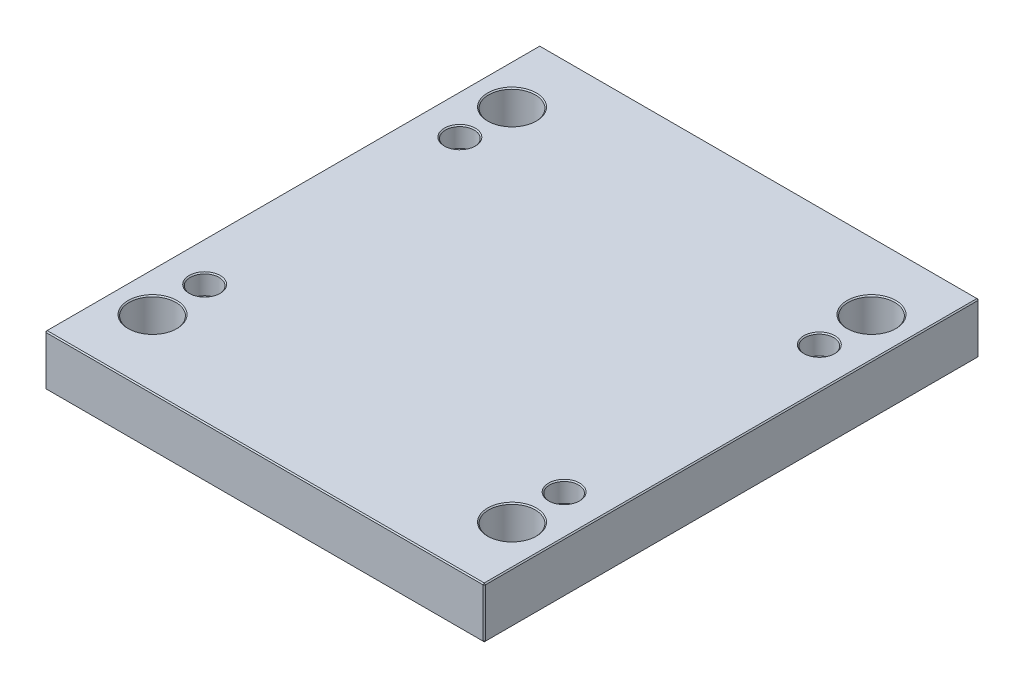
ISO-10303-21;
HEADER;
FILE_DESCRIPTION(('STEP AP214'),'2;1');
FILE_NAME('part.step','',(''),(''),'','','');
FILE_SCHEMA(('AUTOMOTIVE_DESIGN { 1 0 10303 214 1 1 1 1 }'));
ENDSEC;
DATA;
#1=APPLICATION_CONTEXT('core data for automotive mechanical design processes');
#2=APPLICATION_PROTOCOL_DEFINITION('international standard','automotive_design',2000,#1);
#3=PRODUCT_CONTEXT('',#1,'mechanical');
#4=PRODUCT('Part','Part','',(#3));
#5=PRODUCT_RELATED_PRODUCT_CATEGORY('part','',(#4));
#6=PRODUCT_DEFINITION_FORMATION('','',#4);
#7=PRODUCT_DEFINITION_CONTEXT('part definition',#1,'design');
#8=PRODUCT_DEFINITION('design','',#6,#7);
#9=PRODUCT_DEFINITION_SHAPE('','',#8);
#10=(LENGTH_UNIT() NAMED_UNIT(*) SI_UNIT(.MILLI.,.METRE.));
#11=(NAMED_UNIT(*) PLANE_ANGLE_UNIT() SI_UNIT($,.RADIAN.));
#12=(NAMED_UNIT(*) SI_UNIT($,.STERADIAN.) SOLID_ANGLE_UNIT());
#13=UNCERTAINTY_MEASURE_WITH_UNIT(LENGTH_MEASURE(1.E-05),#10,'distance_accuracy_value','');
#14=(GEOMETRIC_REPRESENTATION_CONTEXT(3) GLOBAL_UNCERTAINTY_ASSIGNED_CONTEXT((#13)) GLOBAL_UNIT_ASSIGNED_CONTEXT((#10,
#11,#12)) REPRESENTATION_CONTEXT('',''));
#15=CARTESIAN_POINT('',(0.,0.,0.));
#16=DIRECTION('',(0.,0.,1.));
#17=DIRECTION('',(1.,0.,0.));
#18=AXIS2_PLACEMENT_3D('',#15,#16,#17);
#19=CARTESIAN_POINT('',(-198.,46.,223.));
#20=DIRECTION('',(1.,0.,0.));
#21=DIRECTION('',(0.,0.,-1.));
#22=AXIS2_PLACEMENT_3D('',#19,#20,#21);
#23=PLANE('',#22);
#24=DIRECTION('',(0.,-1.,0.));
#25=VECTOR('',#24,1.);
#26=CARTESIAN_POINT('',(-198.,46.,-222.));
#27=LINE('',#26,#25);
#28=CARTESIAN_POINT('',(-198.,45.,-222.));
#29=VERTEX_POINT('',#28);
#30=CARTESIAN_POINT('',(-198.,1.,-222.));
#31=VERTEX_POINT('',#30);
#32=EDGE_CURVE('E115',#29,#31,#27,.T.);
#33=ORIENTED_EDGE('',*,*,#32,.T.);
#34=DIRECTION('',(0.,0.,1.));
#35=VECTOR('',#34,1.);
#36=CARTESIAN_POINT('',(-198.,1.,223.));
#37=LINE('',#36,#35);
#38=CARTESIAN_POINT('',(-198.,1.,222.));
#39=VERTEX_POINT('',#38);
#40=EDGE_CURVE('E111',#31,#39,#37,.T.);
#41=ORIENTED_EDGE('',*,*,#40,.T.);
#42=DIRECTION('',(0.,1.,0.));
#43=VECTOR('',#42,1.);
#44=CARTESIAN_POINT('',(-198.,46.,222.));
#45=LINE('',#44,#43);
#46=CARTESIAN_POINT('',(-198.,45.,222.));
#47=VERTEX_POINT('',#46);
#48=EDGE_CURVE('E104',#39,#47,#45,.T.);
#49=ORIENTED_EDGE('',*,*,#48,.T.);
#50=DIRECTION('',(0.,0.,-1.));
#51=VECTOR('',#50,1.);
#52=CARTESIAN_POINT('',(-198.,45.,-223.));
#53=LINE('',#52,#51);
#54=EDGE_CURVE('E108',#47,#29,#53,.T.);
#55=ORIENTED_EDGE('',*,*,#54,.T.);
#56=EDGE_LOOP('',(#33,#41,#49,#55));
#57=FACE_BOUND('',#56,.T.);
#58=ADVANCED_FACE('F16',(#57),#23,.F.);
#59=CARTESIAN_POINT('',(198.,46.,223.));
#60=DIRECTION('',(0.,0.,-1.));
#61=DIRECTION('',(-1.,0.,0.));
#62=AXIS2_PLACEMENT_3D('',#59,#60,#61);
#63=PLANE('',#62);
#64=DIRECTION('',(-1.,0.,0.));
#65=VECTOR('',#64,1.);
#66=CARTESIAN_POINT('',(-198.,45.,223.));
#67=LINE('',#66,#65);
#68=CARTESIAN_POINT('',(197.,45.,223.));
#69=VERTEX_POINT('',#68);
#70=CARTESIAN_POINT('',(-197.,45.,223.));
#71=VERTEX_POINT('',#70);
#72=EDGE_CURVE('E170',#69,#71,#67,.T.);
#73=ORIENTED_EDGE('',*,*,#72,.T.);
#74=DIRECTION('',(0.,-1.,0.));
#75=VECTOR('',#74,1.);
#76=CARTESIAN_POINT('',(-197.,46.,223.));
#77=LINE('',#76,#75);
#78=CARTESIAN_POINT('',(-197.,0.999999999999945,223.));
#79=VERTEX_POINT('',#78);
#80=EDGE_CURVE('E123',#71,#79,#77,.T.);
#81=ORIENTED_EDGE('',*,*,#80,.T.);
#82=DIRECTION('',(1.,0.,0.));
#83=VECTOR('',#82,1.);
#84=CARTESIAN_POINT('',(198.,0.999999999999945,223.));
#85=LINE('',#84,#83);
#86=CARTESIAN_POINT('',(197.,0.999999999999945,223.));
#87=VERTEX_POINT('',#86);
#88=EDGE_CURVE('E174',#79,#87,#85,.T.);
#89=ORIENTED_EDGE('',*,*,#88,.T.);
#90=DIRECTION('',(0.,1.,0.));
#91=VECTOR('',#90,1.);
#92=CARTESIAN_POINT('',(197.,46.,223.));
#93=LINE('',#92,#91);
#94=EDGE_CURVE('E172',#87,#69,#93,.T.);
#95=ORIENTED_EDGE('',*,*,#94,.T.);
#96=EDGE_LOOP('',(#73,#81,#89,#95));
#97=FACE_BOUND('',#96,.T.);
#98=ADVANCED_FACE('F413',(#97),#63,.F.);
#99=CARTESIAN_POINT('',(198.,46.,223.));
#100=DIRECTION('',(-1.,0.,0.));
#101=DIRECTION('',(0.,0.,1.));
#102=AXIS2_PLACEMENT_3D('',#99,#100,#101);
#103=PLANE('',#102);
#104=DIRECTION('',(0.,0.,-1.));
#105=VECTOR('',#104,1.);
#106=CARTESIAN_POINT('',(198.,0.999999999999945,223.));
#107=LINE('',#106,#105);
#108=CARTESIAN_POINT('',(198.,0.999999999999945,222.));
#109=VERTEX_POINT('',#108);
#110=CARTESIAN_POINT('',(198.,0.999999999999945,-222.));
#111=VERTEX_POINT('',#110);
#112=EDGE_CURVE('E165',#109,#111,#107,.T.);
#113=ORIENTED_EDGE('',*,*,#112,.T.);
#114=DIRECTION('',(0.,1.,0.));
#115=VECTOR('',#114,1.);
#116=CARTESIAN_POINT('',(198.,46.,-222.));
#117=LINE('',#116,#115);
#118=CARTESIAN_POINT('',(198.,45.,-222.));
#119=VERTEX_POINT('',#118);
#120=EDGE_CURVE('E167',#111,#119,#117,.T.);
#121=ORIENTED_EDGE('',*,*,#120,.T.);
#122=DIRECTION('',(0.,0.,1.));
#123=VECTOR('',#122,1.);
#124=CARTESIAN_POINT('',(198.,45.,223.));
#125=LINE('',#124,#123);
#126=CARTESIAN_POINT('',(198.,45.,222.));
#127=VERTEX_POINT('',#126);
#128=EDGE_CURVE('E161',#119,#127,#125,.T.);
#129=ORIENTED_EDGE('',*,*,#128,.T.);
#130=DIRECTION('',(0.,-1.,0.));
#131=VECTOR('',#130,1.);
#132=CARTESIAN_POINT('',(198.,46.,222.));
#133=LINE('',#132,#131);
#134=EDGE_CURVE('E163',#127,#109,#133,.T.);
#135=ORIENTED_EDGE('',*,*,#134,.T.);
#136=EDGE_LOOP('',(#113,#121,#129,#135));
#137=FACE_BOUND('',#136,.T.);
#138=ADVANCED_FACE('F406',(#137),#103,.F.);
#139=CARTESIAN_POINT('',(198.,46.,-223.));
#140=DIRECTION('',(0.,0.,1.));
#141=DIRECTION('',(1.,0.,0.));
#142=AXIS2_PLACEMENT_3D('',#139,#140,#141);
#143=PLANE('',#142);
#144=DIRECTION('',(0.,-1.,0.));
#145=VECTOR('',#144,1.);
#146=CARTESIAN_POINT('',(197.,46.,-223.));
#147=LINE('',#146,#145);
#148=CARTESIAN_POINT('',(197.,45.,-223.));
#149=VERTEX_POINT('',#148);
#150=CARTESIAN_POINT('',(197.,0.999999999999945,-223.));
#151=VERTEX_POINT('',#150);
#152=EDGE_CURVE('E154',#149,#151,#147,.T.);
#153=ORIENTED_EDGE('',*,*,#152,.T.);
#154=DIRECTION('',(-1.,0.,0.));
#155=VECTOR('',#154,1.);
#156=CARTESIAN_POINT('',(198.,0.999999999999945,-223.));
#157=LINE('',#156,#155);
#158=CARTESIAN_POINT('',(-197.,0.999999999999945,-223.));
#159=VERTEX_POINT('',#158);
#160=EDGE_CURVE('E159',#151,#159,#157,.T.);
#161=ORIENTED_EDGE('',*,*,#160,.T.);
#162=DIRECTION('',(0.,1.,0.));
#163=VECTOR('',#162,1.);
#164=CARTESIAN_POINT('',(-197.,46.,-223.));
#165=LINE('',#164,#163);
#166=CARTESIAN_POINT('',(-197.,45.,-223.));
#167=VERTEX_POINT('',#166);
#168=EDGE_CURVE('E156',#159,#167,#165,.T.);
#169=ORIENTED_EDGE('',*,*,#168,.T.);
#170=DIRECTION('',(1.,0.,0.));
#171=VECTOR('',#170,1.);
#172=CARTESIAN_POINT('',(198.,45.,-223.));
#173=LINE('',#172,#171);
#174=EDGE_CURVE('E152',#167,#149,#173,.T.);
#175=ORIENTED_EDGE('',*,*,#174,.T.);
#176=EDGE_LOOP('',(#153,#161,#169,#175));
#177=FACE_BOUND('',#176,.T.);
#178=ADVANCED_FACE('F431',(#177),#143,.F.);
#179=CARTESIAN_POINT('',(0.,46.,0.));
#180=DIRECTION('',(0.,1.,0.));
#181=DIRECTION('',(0.,0.,1.));
#182=AXIS2_PLACEMENT_3D('',#179,#180,#181);
#183=PLANE('',#182);
#184=CARTESIAN_POINT('',(-162.,46.,162.));
#185=DIRECTION('',(0.,1.,0.));
#186=DIRECTION('',(0.,0.,1.));
#187=AXIS2_PLACEMENT_3D('',#184,#185,#186);
#188=CIRCLE('',#187,22.);
#189=CARTESIAN_POINT('',(-162.,46.,184.));
#190=VERTEX_POINT('',#189);
#191=EDGE_CURVE('E317',#190,#190,#188,.F.);
#192=ORIENTED_EDGE('',*,*,#191,.T.);
#193=EDGE_LOOP('',(#192));
#194=FACE_BOUND('',#193,.T.);
#195=CARTESIAN_POINT('',(162.,46.,162.));
#196=DIRECTION('',(0.,1.,0.));
#197=DIRECTION('',(0.,0.,1.));
#198=AXIS2_PLACEMENT_3D('',#195,#196,#197);
#199=CIRCLE('',#198,22.);
#200=CARTESIAN_POINT('',(162.,46.,184.));
#201=VERTEX_POINT('',#200);
#202=EDGE_CURVE('E314',#201,#201,#199,.F.);
#203=ORIENTED_EDGE('',*,*,#202,.T.);
#204=EDGE_LOOP('',(#203));
#205=FACE_BOUND('',#204,.T.);
#206=CARTESIAN_POINT('',(162.,46.,-162.));
#207=DIRECTION('',(0.,1.,0.));
#208=DIRECTION('',(0.,0.,1.));
#209=AXIS2_PLACEMENT_3D('',#206,#207,#208);
#210=CIRCLE('',#209,22.);
#211=CARTESIAN_POINT('',(162.,46.,-140.));
#212=VERTEX_POINT('',#211);
#213=EDGE_CURVE('E311',#212,#212,#210,.F.);
#214=ORIENTED_EDGE('',*,*,#213,.T.);
#215=EDGE_LOOP('',(#214));
#216=FACE_BOUND('',#215,.T.);
#217=CARTESIAN_POINT('',(-162.,46.,-162.));
#218=DIRECTION('',(0.,1.,0.));
#219=DIRECTION('',(0.,0.,1.));
#220=AXIS2_PLACEMENT_3D('',#217,#218,#219);
#221=CIRCLE('',#220,22.);
#222=CARTESIAN_POINT('',(-162.,46.,-140.));
#223=VERTEX_POINT('',#222);
#224=EDGE_CURVE('E308',#223,#223,#221,.F.);
#225=ORIENTED_EDGE('',*,*,#224,.T.);
#226=EDGE_LOOP('',(#225));
#227=FACE_BOUND('',#226,.T.);
#228=CARTESIAN_POINT('',(-162.,46.,115.));
#229=DIRECTION('',(0.,1.,0.));
#230=DIRECTION('',(0.,0.,1.));
#231=AXIS2_PLACEMENT_3D('',#228,#229,#230);
#232=CIRCLE('',#231,14.);
#233=CARTESIAN_POINT('',(-162.,46.,129.));
#234=VERTEX_POINT('',#233);
#235=EDGE_CURVE('E290',#234,#234,#232,.F.);
#236=ORIENTED_EDGE('',*,*,#235,.T.);
#237=EDGE_LOOP('',(#236));
#238=FACE_BOUND('',#237,.T.);
#239=CARTESIAN_POINT('',(162.,46.,115.));
#240=DIRECTION('',(0.,1.,0.));
#241=DIRECTION('',(0.,0.,1.));
#242=AXIS2_PLACEMENT_3D('',#239,#240,#241);
#243=CIRCLE('',#242,14.);
#244=CARTESIAN_POINT('',(162.,46.,129.));
#245=VERTEX_POINT('',#244);
#246=EDGE_CURVE('E287',#245,#245,#243,.F.);
#247=ORIENTED_EDGE('',*,*,#246,.T.);
#248=EDGE_LOOP('',(#247));
#249=FACE_BOUND('',#248,.T.);
#250=CARTESIAN_POINT('',(162.,46.,-115.));
#251=DIRECTION('',(0.,1.,0.));
#252=DIRECTION('',(0.,0.,1.));
#253=AXIS2_PLACEMENT_3D('',#250,#251,#252);
#254=CIRCLE('',#253,14.);
#255=CARTESIAN_POINT('',(162.,46.,-101.));
#256=VERTEX_POINT('',#255);
#257=EDGE_CURVE('E284',#256,#256,#254,.F.);
#258=ORIENTED_EDGE('',*,*,#257,.T.);
#259=EDGE_LOOP('',(#258));
#260=FACE_BOUND('',#259,.T.);
#261=CARTESIAN_POINT('',(-162.,46.,-115.));
#262=DIRECTION('',(0.,1.,0.));
#263=DIRECTION('',(0.,0.,1.));
#264=AXIS2_PLACEMENT_3D('',#261,#262,#263);
#265=CIRCLE('',#264,14.);
#266=CARTESIAN_POINT('',(-162.,46.,-101.));
#267=VERTEX_POINT('',#266);
#268=EDGE_CURVE('E281',#267,#267,#265,.F.);
#269=ORIENTED_EDGE('',*,*,#268,.T.);
#270=EDGE_LOOP('',(#269));
#271=FACE_BOUND('',#270,.T.);
#272=DIRECTION('',(0.,0.,-1.));
#273=VECTOR('',#272,1.);
#274=CARTESIAN_POINT('',(197.,46.,-223.));
#275=LINE('',#274,#273);
#276=CARTESIAN_POINT('',(197.,46.,222.));
#277=VERTEX_POINT('',#276);
#278=CARTESIAN_POINT('',(197.,46.,-222.));
#279=VERTEX_POINT('',#278);
#280=EDGE_CURVE('E31',#277,#279,#275,.T.);
#281=ORIENTED_EDGE('',*,*,#280,.T.);
#282=DIRECTION('',(-1.,0.,0.));
#283=VECTOR('',#282,1.);
#284=CARTESIAN_POINT('',(-198.,46.,-222.));
#285=LINE('',#284,#283);
#286=CARTESIAN_POINT('',(-197.,46.,-222.));
#287=VERTEX_POINT('',#286);
#288=EDGE_CURVE('E190',#279,#287,#285,.T.);
#289=ORIENTED_EDGE('',*,*,#288,.T.);
#290=DIRECTION('',(0.,0.,1.));
#291=VECTOR('',#290,1.);
#292=CARTESIAN_POINT('',(-197.,46.,223.));
#293=LINE('',#292,#291);
#294=CARTESIAN_POINT('',(-197.,46.,222.));
#295=VERTEX_POINT('',#294);
#296=EDGE_CURVE('E186',#287,#295,#293,.T.);
#297=ORIENTED_EDGE('',*,*,#296,.T.);
#298=DIRECTION('',(1.,0.,0.));
#299=VECTOR('',#298,1.);
#300=CARTESIAN_POINT('',(198.,46.,222.));
#301=LINE('',#300,#299);
#302=EDGE_CURVE('E36',#295,#277,#301,.T.);
#303=ORIENTED_EDGE('',*,*,#302,.T.);
#304=EDGE_LOOP('',(#281,#289,#297,#303));
#305=FACE_BOUND('',#304,.T.);
#306=ADVANCED_FACE('F357',(#194,#205,#216,#227,#238,#249,#260,#271,#305),#183,.T.);
#307=CARTESIAN_POINT('',(0.,0.,0.));
#308=DIRECTION('',(0.,1.,0.));
#309=DIRECTION('',(0.,0.,1.));
#310=AXIS2_PLACEMENT_3D('',#307,#308,#309);
#311=PLANE('',#310);
#312=CARTESIAN_POINT('',(-162.,0.,162.));
#313=DIRECTION('',(0.,1.,0.));
#314=DIRECTION('',(0.,0.,1.));
#315=AXIS2_PLACEMENT_3D('',#312,#313,#314);
#316=CIRCLE('',#315,22.);
#317=CARTESIAN_POINT('',(-162.,0.,184.));
#318=VERTEX_POINT('',#317);
#319=EDGE_CURVE('E329',#318,#318,#316,.T.);
#320=ORIENTED_EDGE('',*,*,#319,.T.);
#321=EDGE_LOOP('',(#320));
#322=FACE_BOUND('',#321,.T.);
#323=CARTESIAN_POINT('',(162.,0.,162.));
#324=DIRECTION('',(0.,1.,0.));
#325=DIRECTION('',(0.,0.,1.));
#326=AXIS2_PLACEMENT_3D('',#323,#324,#325);
#327=CIRCLE('',#326,22.);
#328=CARTESIAN_POINT('',(162.,0.,184.));
#329=VERTEX_POINT('',#328);
#330=EDGE_CURVE('E326',#329,#329,#327,.T.);
#331=ORIENTED_EDGE('',*,*,#330,.T.);
#332=EDGE_LOOP('',(#331));
#333=FACE_BOUND('',#332,.T.);
#334=CARTESIAN_POINT('',(162.,0.,-162.));
#335=DIRECTION('',(0.,1.,0.));
#336=DIRECTION('',(0.,0.,1.));
#337=AXIS2_PLACEMENT_3D('',#334,#335,#336);
#338=CIRCLE('',#337,22.);
#339=CARTESIAN_POINT('',(162.,0.,-140.));
#340=VERTEX_POINT('',#339);
#341=EDGE_CURVE('E323',#340,#340,#338,.T.);
#342=ORIENTED_EDGE('',*,*,#341,.T.);
#343=EDGE_LOOP('',(#342));
#344=FACE_BOUND('',#343,.T.);
#345=CARTESIAN_POINT('',(-162.,0.,-162.));
#346=DIRECTION('',(0.,1.,0.));
#347=DIRECTION('',(0.,0.,1.));
#348=AXIS2_PLACEMENT_3D('',#345,#346,#347);
#349=CIRCLE('',#348,22.);
#350=CARTESIAN_POINT('',(-162.,0.,-140.));
#351=VERTEX_POINT('',#350);
#352=EDGE_CURVE('E320',#351,#351,#349,.T.);
#353=ORIENTED_EDGE('',*,*,#352,.T.);
#354=EDGE_LOOP('',(#353));
#355=FACE_BOUND('',#354,.T.);
#356=CARTESIAN_POINT('',(162.,0.,-115.));
#357=DIRECTION('',(0.,1.,0.));
#358=DIRECTION('',(0.,0.,1.));
#359=AXIS2_PLACEMENT_3D('',#356,#357,#358);
#360=CIRCLE('',#359,10.);
#361=CARTESIAN_POINT('',(162.,0.,-105.));
#362=VERTEX_POINT('',#361);
#363=EDGE_CURVE('E263',#362,#362,#360,.T.);
#364=ORIENTED_EDGE('',*,*,#363,.T.);
#365=EDGE_LOOP('',(#364));
#366=FACE_BOUND('',#365,.T.);
#367=CARTESIAN_POINT('',(162.,0.,115.));
#368=DIRECTION('',(0.,1.,0.));
#369=DIRECTION('',(0.,0.,1.));
#370=AXIS2_PLACEMENT_3D('',#367,#368,#369);
#371=CIRCLE('',#370,10.);
#372=CARTESIAN_POINT('',(162.,0.,125.));
#373=VERTEX_POINT('',#372);
#374=EDGE_CURVE('E260',#373,#373,#371,.T.);
#375=ORIENTED_EDGE('',*,*,#374,.T.);
#376=EDGE_LOOP('',(#375));
#377=FACE_BOUND('',#376,.T.);
#378=CARTESIAN_POINT('',(-162.,0.,115.));
#379=DIRECTION('',(0.,1.,0.));
#380=DIRECTION('',(0.,0.,1.));
#381=AXIS2_PLACEMENT_3D('',#378,#379,#380);
#382=CIRCLE('',#381,10.);
#383=CARTESIAN_POINT('',(-162.,0.,125.));
#384=VERTEX_POINT('',#383);
#385=EDGE_CURVE('E257',#384,#384,#382,.T.);
#386=ORIENTED_EDGE('',*,*,#385,.T.);
#387=EDGE_LOOP('',(#386));
#388=FACE_BOUND('',#387,.T.);
#389=CARTESIAN_POINT('',(-162.,0.,-115.));
#390=DIRECTION('',(0.,1.,0.));
#391=DIRECTION('',(0.,0.,1.));
#392=AXIS2_PLACEMENT_3D('',#389,#390,#391);
#393=CIRCLE('',#392,10.);
#394=CARTESIAN_POINT('',(-162.,0.,-105.));
#395=VERTEX_POINT('',#394);
#396=EDGE_CURVE('E192',#395,#395,#393,.T.);
#397=ORIENTED_EDGE('',*,*,#396,.T.);
#398=EDGE_LOOP('',(#397));
#399=FACE_BOUND('',#398,.T.);
#400=DIRECTION('',(0.,0.,1.));
#401=VECTOR('',#400,1.);
#402=CARTESIAN_POINT('',(197.,0.,0.));
#403=LINE('',#402,#401);
#404=CARTESIAN_POINT('',(197.,0.,-222.));
#405=VERTEX_POINT('',#404);
#406=CARTESIAN_POINT('',(197.,0.,222.));
#407=VERTEX_POINT('',#406);
#408=EDGE_CURVE('E177',#405,#407,#403,.T.);
#409=ORIENTED_EDGE('',*,*,#408,.T.);
#410=DIRECTION('',(-1.,0.,0.));
#411=VECTOR('',#410,1.);
#412=CARTESIAN_POINT('',(0.,0.,222.));
#413=LINE('',#412,#411);
#414=CARTESIAN_POINT('',(-197.,0.,222.));
#415=VERTEX_POINT('',#414);
#416=EDGE_CURVE('E183',#407,#415,#413,.T.);
#417=ORIENTED_EDGE('',*,*,#416,.T.);
#418=DIRECTION('',(0.,0.,-1.));
#419=VECTOR('',#418,1.);
#420=CARTESIAN_POINT('',(-197.,0.,0.));
#421=LINE('',#420,#419);
#422=CARTESIAN_POINT('',(-197.,0.,-222.));
#423=VERTEX_POINT('',#422);
#424=EDGE_CURVE('E181',#415,#423,#421,.T.);
#425=ORIENTED_EDGE('',*,*,#424,.T.);
#426=DIRECTION('',(1.,0.,0.));
#427=VECTOR('',#426,1.);
#428=CARTESIAN_POINT('',(0.,0.,-222.));
#429=LINE('',#428,#427);
#430=EDGE_CURVE('E179',#423,#405,#429,.T.);
#431=ORIENTED_EDGE('',*,*,#430,.T.);
#432=EDGE_LOOP('',(#409,#417,#425,#431));
#433=FACE_BOUND('',#432,.T.);
#434=ADVANCED_FACE('F353',(#322,#333,#344,#355,#366,#377,#388,#399,#433),#311,.F.);
#435=CARTESIAN_POINT('',(198.,46.,222.));
#436=DIRECTION('',(-0.707106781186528,0.,-0.707106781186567));
#437=DIRECTION('',(0.,-1.,0.));
#438=AXIS2_PLACEMENT_3D('',#435,#436,#437);
#439=PLANE('',#438);
#440=DIRECTION('',(-0.707106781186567,0.,0.707106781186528));
#441=VECTOR('',#440,1.);
#442=CARTESIAN_POINT('',(197.,45.,223.));
#443=LINE('',#442,#441);
#444=EDGE_CURVE('E141',#69,#127,#443,.F.);
#445=ORIENTED_EDGE('',*,*,#444,.F.);
#446=ORIENTED_EDGE('',*,*,#94,.F.);
#447=DIRECTION('',(0.707106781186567,0.,-0.707106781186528));
#448=VECTOR('',#447,1.);
#449=CARTESIAN_POINT('',(197.,0.999999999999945,223.));
#450=LINE('',#449,#448);
#451=EDGE_CURVE('E144',#109,#87,#450,.F.);
#452=ORIENTED_EDGE('',*,*,#451,.F.);
#453=ORIENTED_EDGE('',*,*,#134,.F.);
#454=EDGE_LOOP('',(#445,#446,#452,#453));
#455=FACE_BOUND('',#454,.T.);
#456=ADVANCED_FACE('F356',(#455),#439,.F.);
#457=CARTESIAN_POINT('',(197.,45.,223.));
#458=DIRECTION('',(0.577350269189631,0.577350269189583,0.577350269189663));
#459=DIRECTION('',(0.707106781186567,0.,-0.707106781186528));
#460=AXIS2_PLACEMENT_3D('',#457,#458,#459);
#461=PLANE('',#460);
#462=DIRECTION('',(0.,-0.707106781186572,0.707106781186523));
#463=VECTOR('',#462,1.);
#464=CARTESIAN_POINT('',(197.,45.,223.));
#465=LINE('',#464,#463);
#466=EDGE_CURVE('E235',#69,#277,#465,.F.);
#467=ORIENTED_EDGE('',*,*,#466,.F.);
#468=ORIENTED_EDGE('',*,*,#444,.T.);
#469=DIRECTION('',(-0.707106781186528,0.707106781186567,0.));
#470=VECTOR('',#469,1.);
#471=CARTESIAN_POINT('',(197.5,45.5,222.));
#472=LINE('',#471,#470);
#473=EDGE_CURVE('E237',#277,#127,#472,.F.);
#474=ORIENTED_EDGE('',*,*,#473,.F.);
#475=EDGE_LOOP('',(#467,#468,#474));
#476=FACE_BOUND('',#475,.T.);
#477=ADVANCED_FACE('F419',(#476),#461,.T.);
#478=CARTESIAN_POINT('',(197.,0.999999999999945,223.));
#479=DIRECTION('',(0.577350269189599,-0.577350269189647,0.577350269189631));
#480=DIRECTION('',(0.,-0.707106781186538,-0.707106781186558));
#481=AXIS2_PLACEMENT_3D('',#478,#479,#480);
#482=PLANE('',#481);
#483=DIRECTION('',(-0.707106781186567,-0.707106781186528,0.));
#484=VECTOR('',#483,1.);
#485=CARTESIAN_POINT('',(197.5,0.499999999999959,222.));
#486=LINE('',#485,#484);
#487=EDGE_CURVE('E229',#109,#407,#486,.T.);
#488=ORIENTED_EDGE('',*,*,#487,.F.);
#489=ORIENTED_EDGE('',*,*,#451,.T.);
#490=DIRECTION('',(0.,0.707106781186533,0.707106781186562));
#491=VECTOR('',#490,1.);
#492=CARTESIAN_POINT('',(197.,0.999999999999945,223.));
#493=LINE('',#492,#491);
#494=EDGE_CURVE('E232',#407,#87,#493,.T.);
#495=ORIENTED_EDGE('',*,*,#494,.F.);
#496=EDGE_LOOP('',(#488,#489,#495));
#497=FACE_BOUND('',#496,.T.);
#498=ADVANCED_FACE('F378',(#497),#482,.T.);
#499=CARTESIAN_POINT('',(197.,46.,0.));
#500=DIRECTION('',(0.707106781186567,0.707106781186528,0.));
#501=DIRECTION('',(0.,0.,1.));
#502=AXIS2_PLACEMENT_3D('',#499,#500,#501);
#503=PLANE('',#502);
#504=ORIENTED_EDGE('',*,*,#473,.T.);
#505=ORIENTED_EDGE('',*,*,#128,.F.);
#506=DIRECTION('',(0.707106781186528,-0.707106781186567,0.));
#507=VECTOR('',#506,1.);
#508=CARTESIAN_POINT('',(198.,45.,-222.));
#509=LINE('',#508,#507);
#510=EDGE_CURVE('E224',#279,#119,#509,.T.);
#511=ORIENTED_EDGE('',*,*,#510,.F.);
#512=ORIENTED_EDGE('',*,*,#280,.F.);
#513=EDGE_LOOP('',(#504,#505,#511,#512));
#514=FACE_BOUND('',#513,.T.);
#515=ADVANCED_FACE('F421',(#514),#503,.T.);
#516=CARTESIAN_POINT('',(0.,46.,222.));
#517=DIRECTION('',(0.,0.707106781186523,0.707106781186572));
#518=DIRECTION('',(-1.,0.,0.));
#519=AXIS2_PLACEMENT_3D('',#516,#517,#518);
#520=PLANE('',#519);
#521=ORIENTED_EDGE('',*,*,#466,.T.);
#522=ORIENTED_EDGE('',*,*,#302,.F.);
#523=DIRECTION('',(0.,0.707106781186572,-0.707106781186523));
#524=VECTOR('',#523,1.);
#525=CARTESIAN_POINT('',(-197.,45.5,222.5));
#526=LINE('',#525,#524);
#527=EDGE_CURVE('E127',#71,#295,#526,.T.);
#528=ORIENTED_EDGE('',*,*,#527,.F.);
#529=ORIENTED_EDGE('',*,*,#72,.F.);
#530=EDGE_LOOP('',(#521,#522,#528,#529));
#531=FACE_BOUND('',#530,.T.);
#532=ADVANCED_FACE('F416',(#531),#520,.T.);
#533=CARTESIAN_POINT('',(-197.,46.,223.));
#534=DIRECTION('',(0.707106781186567,0.,-0.707106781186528));
#535=DIRECTION('',(0.,-1.,0.));
#536=AXIS2_PLACEMENT_3D('',#533,#534,#535);
#537=PLANE('',#536);
#538=DIRECTION('',(0.707106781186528,0.,0.707106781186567));
#539=VECTOR('',#538,1.);
#540=CARTESIAN_POINT('',(-197.,0.999999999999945,223.));
#541=LINE('',#540,#539);
#542=EDGE_CURVE('E128',#79,#39,#541,.F.);
#543=ORIENTED_EDGE('',*,*,#542,.F.);
#544=ORIENTED_EDGE('',*,*,#80,.F.);
#545=DIRECTION('',(-0.707106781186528,0.,-0.707106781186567));
#546=VECTOR('',#545,1.);
#547=CARTESIAN_POINT('',(-198.,45.,222.));
#548=LINE('',#547,#546);
#549=EDGE_CURVE('E119',#47,#71,#548,.F.);
#550=ORIENTED_EDGE('',*,*,#549,.F.);
#551=ORIENTED_EDGE('',*,*,#48,.F.);
#552=EDGE_LOOP('',(#543,#544,#550,#551));
#553=FACE_BOUND('',#552,.T.);
#554=ADVANCED_FACE('F121',(#553),#537,.F.);
#555=CARTESIAN_POINT('',(198.,0.999999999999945,223.));
#556=DIRECTION('',(0.,0.707106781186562,-0.707106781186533));
#557=DIRECTION('',(1.,0.,0.));
#558=AXIS2_PLACEMENT_3D('',#555,#556,#557);
#559=PLANE('',#558);
#560=ORIENTED_EDGE('',*,*,#494,.T.);
#561=ORIENTED_EDGE('',*,*,#88,.F.);
#562=DIRECTION('',(0.,-0.707106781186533,-0.707106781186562));
#563=VECTOR('',#562,1.);
#564=CARTESIAN_POINT('',(-197.,0.999999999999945,223.));
#565=LINE('',#564,#563);
#566=EDGE_CURVE('E220',#415,#79,#565,.F.);
#567=ORIENTED_EDGE('',*,*,#566,.F.);
#568=ORIENTED_EDGE('',*,*,#416,.F.);
#569=EDGE_LOOP('',(#560,#561,#567,#568));
#570=FACE_BOUND('',#569,.T.);
#571=ADVANCED_FACE('F383',(#570),#559,.F.);
#572=CARTESIAN_POINT('',(198.,0.999999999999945,223.));
#573=DIRECTION('',(-0.707106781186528,0.707106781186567,0.));
#574=DIRECTION('',(0.,0.,-1.));
#575=AXIS2_PLACEMENT_3D('',#572,#573,#574);
#576=PLANE('',#575);
#577=ORIENTED_EDGE('',*,*,#487,.T.);
#578=ORIENTED_EDGE('',*,*,#408,.F.);
#579=DIRECTION('',(0.707106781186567,0.707106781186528,0.));
#580=VECTOR('',#579,1.);
#581=CARTESIAN_POINT('',(197.5,0.499999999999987,-222.));
#582=LINE('',#581,#580);
#583=EDGE_CURVE('E217',#111,#405,#582,.F.);
#584=ORIENTED_EDGE('',*,*,#583,.F.);
#585=ORIENTED_EDGE('',*,*,#112,.F.);
#586=EDGE_LOOP('',(#577,#578,#584,#585));
#587=FACE_BOUND('',#586,.T.);
#588=ADVANCED_FACE('F376',(#587),#576,.F.);
#589=CARTESIAN_POINT('',(197.,46.,-223.));
#590=DIRECTION('',(-0.707106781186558,0.,0.707106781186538));
#591=DIRECTION('',(0.,-1.,0.));
#592=AXIS2_PLACEMENT_3D('',#589,#590,#591);
#593=PLANE('',#592);
#594=DIRECTION('',(0.707106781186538,0.,0.707106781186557));
#595=VECTOR('',#594,1.);
#596=CARTESIAN_POINT('',(198.,45.,-222.));
#597=LINE('',#596,#595);
#598=EDGE_CURVE('E226',#119,#149,#597,.F.);
#599=ORIENTED_EDGE('',*,*,#598,.F.);
#600=ORIENTED_EDGE('',*,*,#120,.F.);
#601=DIRECTION('',(-0.707106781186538,0.,-0.707106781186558));
#602=VECTOR('',#601,1.);
#603=CARTESIAN_POINT('',(197.,0.999999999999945,-223.));
#604=LINE('',#603,#602);
#605=EDGE_CURVE('E214',#151,#111,#604,.F.);
#606=ORIENTED_EDGE('',*,*,#605,.F.);
#607=ORIENTED_EDGE('',*,*,#152,.F.);
#608=EDGE_LOOP('',(#599,#600,#606,#607));
#609=FACE_BOUND('',#608,.T.);
#610=ADVANCED_FACE('F403',(#609),#593,.F.);
#611=CARTESIAN_POINT('',(198.,45.,-222.));
#612=DIRECTION('',(0.577350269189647,0.577350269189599,-0.577350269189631));
#613=DIRECTION('',(-0.707106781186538,0.,-0.707106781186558));
#614=AXIS2_PLACEMENT_3D('',#611,#612,#613);
#615=PLANE('',#614);
#616=ORIENTED_EDGE('',*,*,#510,.T.);
#617=ORIENTED_EDGE('',*,*,#598,.T.);
#618=DIRECTION('',(0.,0.707106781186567,0.707106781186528));
#619=VECTOR('',#618,1.);
#620=CARTESIAN_POINT('',(197.,45.5,-222.5));
#621=LINE('',#620,#619);
#622=EDGE_CURVE('E135',#279,#149,#621,.F.);
#623=ORIENTED_EDGE('',*,*,#622,.F.);
#624=EDGE_LOOP('',(#616,#617,#623));
#625=FACE_BOUND('',#624,.T.);
#626=ADVANCED_FACE('F425',(#625),#615,.T.);
#627=CARTESIAN_POINT('',(-198.,45.,222.));
#628=DIRECTION('',(-0.577350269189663,0.577350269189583,0.577350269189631));
#629=DIRECTION('',(0.707106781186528,0.,0.707106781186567));
#630=AXIS2_PLACEMENT_3D('',#627,#628,#629);
#631=PLANE('',#630);
#632=ORIENTED_EDGE('',*,*,#549,.T.);
#633=ORIENTED_EDGE('',*,*,#527,.T.);
#634=DIRECTION('',(-0.707106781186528,-0.707106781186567,0.));
#635=VECTOR('',#634,1.);
#636=CARTESIAN_POINT('',(-198.,45.,222.));
#637=LINE('',#636,#635);
#638=EDGE_CURVE('E131',#47,#295,#637,.F.);
#639=ORIENTED_EDGE('',*,*,#638,.F.);
#640=EDGE_LOOP('',(#632,#633,#639));
#641=FACE_BOUND('',#640,.T.);
#642=ADVANCED_FACE('F132',(#641),#631,.T.);
#643=CARTESIAN_POINT('',(-197.,0.999999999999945,223.));
#644=DIRECTION('',(-0.577350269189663,-0.577350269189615,0.577350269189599));
#645=DIRECTION('',(0.707106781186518,-0.707106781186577,0.));
#646=AXIS2_PLACEMENT_3D('',#643,#644,#645);
#647=PLANE('',#646);
#648=ORIENTED_EDGE('',*,*,#566,.T.);
#649=ORIENTED_EDGE('',*,*,#542,.T.);
#650=DIRECTION('',(-0.707106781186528,0.707106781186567,0.));
#651=VECTOR('',#650,1.);
#652=CARTESIAN_POINT('',(-197.5,0.499999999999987,222.));
#653=LINE('',#652,#651);
#654=EDGE_CURVE('E136',#415,#39,#653,.T.);
#655=ORIENTED_EDGE('',*,*,#654,.F.);
#656=EDGE_LOOP('',(#648,#649,#655));
#657=FACE_BOUND('',#656,.T.);
#658=ADVANCED_FACE('F386',(#657),#647,.T.);
#659=CARTESIAN_POINT('',(197.,0.999999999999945,-223.));
#660=DIRECTION('',(0.577350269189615,-0.577350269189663,-0.577350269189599));
#661=DIRECTION('',(0.707106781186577,0.707106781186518,0.));
#662=AXIS2_PLACEMENT_3D('',#659,#660,#661);
#663=PLANE('',#662);
#664=ORIENTED_EDGE('',*,*,#605,.T.);
#665=ORIENTED_EDGE('',*,*,#583,.T.);
#666=DIRECTION('',(0.,-0.707106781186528,0.707106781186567));
#667=VECTOR('',#666,1.);
#668=CARTESIAN_POINT('',(197.,0.999999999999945,-223.));
#669=LINE('',#668,#667);
#670=EDGE_CURVE('E207',#151,#405,#669,.T.);
#671=ORIENTED_EDGE('',*,*,#670,.F.);
#672=EDGE_LOOP('',(#664,#665,#671));
#673=FACE_BOUND('',#672,.T.);
#674=ADVANCED_FACE('F397',(#673),#663,.T.);
#675=CARTESIAN_POINT('',(0.,46.,-222.));
#676=DIRECTION('',(0.,0.707106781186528,-0.707106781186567));
#677=DIRECTION('',(1.,0.,0.));
#678=AXIS2_PLACEMENT_3D('',#675,#676,#677);
#679=PLANE('',#678);
#680=ORIENTED_EDGE('',*,*,#622,.T.);
#681=ORIENTED_EDGE('',*,*,#174,.F.);
#682=DIRECTION('',(0.,-0.707106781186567,-0.707106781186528));
#683=VECTOR('',#682,1.);
#684=CARTESIAN_POINT('',(-197.,45.,-223.));
#685=LINE('',#684,#683);
#686=EDGE_CURVE('E204',#287,#167,#685,.T.);
#687=ORIENTED_EDGE('',*,*,#686,.F.);
#688=ORIENTED_EDGE('',*,*,#288,.F.);
#689=EDGE_LOOP('',(#680,#681,#687,#688));
#690=FACE_BOUND('',#689,.T.);
#691=ADVANCED_FACE('F429',(#690),#679,.T.);
#692=CARTESIAN_POINT('',(-197.,46.,0.));
#693=DIRECTION('',(-0.707106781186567,0.707106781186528,0.));
#694=DIRECTION('',(0.,0.,-1.));
#695=AXIS2_PLACEMENT_3D('',#692,#693,#694);
#696=PLANE('',#695);
#697=ORIENTED_EDGE('',*,*,#638,.T.);
#698=ORIENTED_EDGE('',*,*,#296,.F.);
#699=DIRECTION('',(0.707106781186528,0.707106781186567,0.));
#700=VECTOR('',#699,1.);
#701=CARTESIAN_POINT('',(-197.5,45.5,-222.));
#702=LINE('',#701,#700);
#703=EDGE_CURVE('E139',#29,#287,#702,.T.);
#704=ORIENTED_EDGE('',*,*,#703,.F.);
#705=ORIENTED_EDGE('',*,*,#54,.F.);
#706=EDGE_LOOP('',(#697,#698,#704,#705));
#707=FACE_BOUND('',#706,.T.);
#708=ADVANCED_FACE('F138',(#707),#696,.T.);
#709=CARTESIAN_POINT('',(-198.,1.,223.));
#710=DIRECTION('',(0.707106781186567,0.707106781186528,0.));
#711=DIRECTION('',(0.,0.,1.));
#712=AXIS2_PLACEMENT_3D('',#709,#710,#711);
#713=PLANE('',#712);
#714=ORIENTED_EDGE('',*,*,#654,.T.);
#715=ORIENTED_EDGE('',*,*,#40,.F.);
#716=DIRECTION('',(0.707106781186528,-0.707106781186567,0.));
#717=VECTOR('',#716,1.);
#718=CARTESIAN_POINT('',(-198.,1.,-222.));
#719=LINE('',#718,#717);
#720=EDGE_CURVE('E200',#423,#31,#719,.F.);
#721=ORIENTED_EDGE('',*,*,#720,.F.);
#722=ORIENTED_EDGE('',*,*,#424,.F.);
#723=EDGE_LOOP('',(#714,#715,#721,#722));
#724=FACE_BOUND('',#723,.T.);
#725=ADVANCED_FACE('F388',(#724),#713,.F.);
#726=CARTESIAN_POINT('',(198.,0.999999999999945,-223.));
#727=DIRECTION('',(0.,0.707106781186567,0.707106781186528));
#728=DIRECTION('',(-1.,0.,0.));
#729=AXIS2_PLACEMENT_3D('',#726,#727,#728);
#730=PLANE('',#729);
#731=ORIENTED_EDGE('',*,*,#670,.T.);
#732=ORIENTED_EDGE('',*,*,#430,.F.);
#733=DIRECTION('',(0.,0.707106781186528,-0.707106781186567));
#734=VECTOR('',#733,1.);
#735=CARTESIAN_POINT('',(-197.,0.499999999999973,-222.5));
#736=LINE('',#735,#734);
#737=EDGE_CURVE('E197',#159,#423,#736,.F.);
#738=ORIENTED_EDGE('',*,*,#737,.F.);
#739=ORIENTED_EDGE('',*,*,#160,.F.);
#740=EDGE_LOOP('',(#731,#732,#738,#739));
#741=FACE_BOUND('',#740,.T.);
#742=ADVANCED_FACE('F392',(#741),#730,.F.);
#743=CARTESIAN_POINT('',(-197.,45.,-223.));
#744=DIRECTION('',(-0.577350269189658,0.577350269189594,-0.577350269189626));
#745=DIRECTION('',(-0.707106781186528,0.,0.707106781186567));
#746=AXIS2_PLACEMENT_3D('',#743,#744,#745);
#747=PLANE('',#746);
#748=ORIENTED_EDGE('',*,*,#703,.T.);
#749=ORIENTED_EDGE('',*,*,#686,.T.);
#750=DIRECTION('',(0.707106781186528,0.,-0.707106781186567));
#751=VECTOR('',#750,1.);
#752=CARTESIAN_POINT('',(-197.,45.,-223.));
#753=LINE('',#752,#751);
#754=EDGE_CURVE('E195',#29,#167,#753,.T.);
#755=ORIENTED_EDGE('',*,*,#754,.F.);
#756=EDGE_LOOP('',(#748,#749,#755));
#757=FACE_BOUND('',#756,.T.);
#758=ADVANCED_FACE('F460',(#757),#747,.T.);
#759=CARTESIAN_POINT('',(-198.,1.,-222.));
#760=DIRECTION('',(-0.577350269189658,-0.577350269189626,-0.577350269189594));
#761=DIRECTION('',(0.707106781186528,-0.707106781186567,0.));
#762=AXIS2_PLACEMENT_3D('',#759,#760,#761);
#763=PLANE('',#762);
#764=ORIENTED_EDGE('',*,*,#737,.T.);
#765=ORIENTED_EDGE('',*,*,#720,.T.);
#766=DIRECTION('',(-0.707106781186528,0.,0.707106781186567));
#767=VECTOR('',#766,1.);
#768=CARTESIAN_POINT('',(-198.,1.,-222.));
#769=LINE('',#768,#767);
#770=EDGE_CURVE('E193',#159,#31,#769,.T.);
#771=ORIENTED_EDGE('',*,*,#770,.F.);
#772=EDGE_LOOP('',(#764,#765,#771));
#773=FACE_BOUND('',#772,.T.);
#774=ADVANCED_FACE('F456',(#773),#763,.T.);
#775=CARTESIAN_POINT('',(-198.,46.,-222.));
#776=DIRECTION('',(0.707106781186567,0.,0.707106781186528));
#777=DIRECTION('',(0.,-1.,0.));
#778=AXIS2_PLACEMENT_3D('',#775,#776,#777);
#779=PLANE('',#778);
#780=ORIENTED_EDGE('',*,*,#754,.T.);
#781=ORIENTED_EDGE('',*,*,#168,.F.);
#782=ORIENTED_EDGE('',*,*,#770,.T.);
#783=ORIENTED_EDGE('',*,*,#32,.F.);
#784=EDGE_LOOP('',(#780,#781,#782,#783));
#785=FACE_BOUND('',#784,.T.);
#786=ADVANCED_FACE('F452',(#785),#779,.F.);
#787=CARTESIAN_POINT('',(-162.,28.,-115.));
#788=DIRECTION('',(0.,1.,0.));
#789=DIRECTION('',(0.,0.,1.));
#790=AXIS2_PLACEMENT_3D('',#787,#788,#789);
#791=CYLINDRICAL_SURFACE('',#790,13.);
#792=CARTESIAN_POINT('',(-162.,45.,-115.));
#793=DIRECTION('',(0.,1.,0.));
#794=DIRECTION('',(0.,0.,1.));
#795=AXIS2_PLACEMENT_3D('',#792,#793,#794);
#796=CIRCLE('',#795,13.);
#797=CARTESIAN_POINT('',(-162.,45.,-102.));
#798=VERTEX_POINT('',#797);
#799=EDGE_CURVE('E299',#798,#798,#796,.T.);
#800=ORIENTED_EDGE('',*,*,#799,.T.);
#801=EDGE_LOOP('',(#800));
#802=FACE_BOUND('',#801,.T.);
#803=CARTESIAN_POINT('',(-162.,28.,-115.));
#804=DIRECTION('',(0.,1.,0.));
#805=DIRECTION('',(0.,0.,1.));
#806=AXIS2_PLACEMENT_3D('',#803,#804,#805);
#807=CIRCLE('',#806,13.);
#808=CARTESIAN_POINT('',(-162.,28.,-102.));
#809=VERTEX_POINT('',#808);
#810=EDGE_CURVE('E147',#809,#809,#807,.T.);
#811=ORIENTED_EDGE('',*,*,#810,.F.);
#812=EDGE_LOOP('',(#811));
#813=FACE_BOUND('',#812,.T.);
#814=ADVANCED_FACE('F455',(#802,#813),#791,.F.);
#815=CARTESIAN_POINT('',(-162.,28.,-115.));
#816=DIRECTION('',(0.,1.,0.));
#817=DIRECTION('',(0.,0.,1.));
#818=AXIS2_PLACEMENT_3D('',#815,#816,#817);
#819=PLANE('',#818);
#820=CARTESIAN_POINT('',(-162.,28.,-115.));
#821=DIRECTION('',(0.,1.,0.));
#822=DIRECTION('',(0.,0.,1.));
#823=AXIS2_PLACEMENT_3D('',#820,#821,#822);
#824=CIRCLE('',#823,9.);
#825=CARTESIAN_POINT('',(-162.,28.,-106.));
#826=VERTEX_POINT('',#825);
#827=EDGE_CURVE('E251',#826,#826,#824,.T.);
#828=ORIENTED_EDGE('',*,*,#827,.F.);
#829=EDGE_LOOP('',(#828));
#830=FACE_BOUND('',#829,.T.);
#831=ORIENTED_EDGE('',*,*,#810,.T.);
#832=EDGE_LOOP('',(#831));
#833=FACE_BOUND('',#832,.T.);
#834=ADVANCED_FACE('F602',(#830,#833),#819,.T.);
#835=CARTESIAN_POINT('',(162.,28.,-115.));
#836=DIRECTION('',(0.,1.,0.));
#837=DIRECTION('',(0.,0.,1.));
#838=AXIS2_PLACEMENT_3D('',#835,#836,#837);
#839=CYLINDRICAL_SURFACE('',#838,13.);
#840=CARTESIAN_POINT('',(162.,45.,-115.));
#841=DIRECTION('',(0.,1.,0.));
#842=DIRECTION('',(0.,0.,1.));
#843=AXIS2_PLACEMENT_3D('',#840,#841,#842);
#844=CIRCLE('',#843,13.);
#845=CARTESIAN_POINT('',(162.,45.,-102.));
#846=VERTEX_POINT('',#845);
#847=EDGE_CURVE('E296',#846,#846,#844,.T.);
#848=ORIENTED_EDGE('',*,*,#847,.T.);
#849=EDGE_LOOP('',(#848));
#850=FACE_BOUND('',#849,.T.);
#851=CARTESIAN_POINT('',(162.,28.,-115.));
#852=DIRECTION('',(0.,1.,0.));
#853=DIRECTION('',(0.,0.,1.));
#854=AXIS2_PLACEMENT_3D('',#851,#852,#853);
#855=CIRCLE('',#854,13.);
#856=CARTESIAN_POINT('',(162.,28.,-102.));
#857=VERTEX_POINT('',#856);
#858=EDGE_CURVE('E630',#857,#857,#855,.T.);
#859=ORIENTED_EDGE('',*,*,#858,.F.);
#860=EDGE_LOOP('',(#859));
#861=FACE_BOUND('',#860,.T.);
#862=ADVANCED_FACE('F598',(#850,#861),#839,.F.);
#863=CARTESIAN_POINT('',(162.,28.,-115.));
#864=DIRECTION('',(0.,1.,0.));
#865=DIRECTION('',(0.,0.,1.));
#866=AXIS2_PLACEMENT_3D('',#863,#864,#865);
#867=PLANE('',#866);
#868=CARTESIAN_POINT('',(162.,28.,-115.));
#869=DIRECTION('',(0.,1.,0.));
#870=DIRECTION('',(0.,0.,1.));
#871=AXIS2_PLACEMENT_3D('',#868,#869,#870);
#872=CIRCLE('',#871,9.);
#873=CARTESIAN_POINT('',(162.,28.,-106.));
#874=VERTEX_POINT('',#873);
#875=EDGE_CURVE('E248',#874,#874,#872,.T.);
#876=ORIENTED_EDGE('',*,*,#875,.F.);
#877=EDGE_LOOP('',(#876));
#878=FACE_BOUND('',#877,.T.);
#879=ORIENTED_EDGE('',*,*,#858,.T.);
#880=EDGE_LOOP('',(#879));
#881=FACE_BOUND('',#880,.T.);
#882=ADVANCED_FACE('F594',(#878,#881),#867,.T.);
#883=CARTESIAN_POINT('',(162.,28.,115.));
#884=DIRECTION('',(0.,1.,0.));
#885=DIRECTION('',(0.,0.,1.));
#886=AXIS2_PLACEMENT_3D('',#883,#884,#885);
#887=CYLINDRICAL_SURFACE('',#886,13.);
#888=CARTESIAN_POINT('',(162.,45.,115.));
#889=DIRECTION('',(0.,1.,0.));
#890=DIRECTION('',(0.,0.,1.));
#891=AXIS2_PLACEMENT_3D('',#888,#889,#890);
#892=CIRCLE('',#891,13.);
#893=CARTESIAN_POINT('',(162.,45.,128.));
#894=VERTEX_POINT('',#893);
#895=EDGE_CURVE('E293',#894,#894,#892,.T.);
#896=ORIENTED_EDGE('',*,*,#895,.T.);
#897=EDGE_LOOP('',(#896));
#898=FACE_BOUND('',#897,.T.);
#899=CARTESIAN_POINT('',(162.,28.,115.));
#900=DIRECTION('',(0.,1.,0.));
#901=DIRECTION('',(0.,0.,1.));
#902=AXIS2_PLACEMENT_3D('',#899,#900,#901);
#903=CIRCLE('',#902,13.);
#904=CARTESIAN_POINT('',(162.,28.,128.));
#905=VERTEX_POINT('',#904);
#906=EDGE_CURVE('E632',#905,#905,#903,.T.);
#907=ORIENTED_EDGE('',*,*,#906,.F.);
#908=EDGE_LOOP('',(#907));
#909=FACE_BOUND('',#908,.T.);
#910=ADVANCED_FACE('F597',(#898,#909),#887,.F.);
#911=CARTESIAN_POINT('',(162.,28.,115.));
#912=DIRECTION('',(0.,1.,0.));
#913=DIRECTION('',(0.,0.,1.));
#914=AXIS2_PLACEMENT_3D('',#911,#912,#913);
#915=PLANE('',#914);
#916=CARTESIAN_POINT('',(162.,28.,115.));
#917=DIRECTION('',(0.,1.,0.));
#918=DIRECTION('',(0.,0.,1.));
#919=AXIS2_PLACEMENT_3D('',#916,#917,#918);
#920=CIRCLE('',#919,9.);
#921=CARTESIAN_POINT('',(162.,28.,124.));
#922=VERTEX_POINT('',#921);
#923=EDGE_CURVE('E245',#922,#922,#920,.T.);
#924=ORIENTED_EDGE('',*,*,#923,.F.);
#925=EDGE_LOOP('',(#924));
#926=FACE_BOUND('',#925,.T.);
#927=ORIENTED_EDGE('',*,*,#906,.T.);
#928=EDGE_LOOP('',(#927));
#929=FACE_BOUND('',#928,.T.);
#930=ADVANCED_FACE('F604',(#926,#929),#915,.T.);
#931=CARTESIAN_POINT('',(-162.,28.,115.));
#932=DIRECTION('',(0.,1.,0.));
#933=DIRECTION('',(0.,0.,1.));
#934=AXIS2_PLACEMENT_3D('',#931,#932,#933);
#935=CYLINDRICAL_SURFACE('',#934,13.);
#936=CARTESIAN_POINT('',(-162.,45.,115.));
#937=DIRECTION('',(0.,1.,0.));
#938=DIRECTION('',(0.,0.,1.));
#939=AXIS2_PLACEMENT_3D('',#936,#937,#938);
#940=CIRCLE('',#939,13.);
#941=CARTESIAN_POINT('',(-162.,45.,128.));
#942=VERTEX_POINT('',#941);
#943=EDGE_CURVE('E278',#942,#942,#940,.T.);
#944=ORIENTED_EDGE('',*,*,#943,.T.);
#945=EDGE_LOOP('',(#944));
#946=FACE_BOUND('',#945,.T.);
#947=CARTESIAN_POINT('',(-162.,28.,115.));
#948=DIRECTION('',(0.,1.,0.));
#949=DIRECTION('',(0.,0.,1.));
#950=AXIS2_PLACEMENT_3D('',#947,#948,#949);
#951=CIRCLE('',#950,13.);
#952=CARTESIAN_POINT('',(-162.,28.,128.));
#953=VERTEX_POINT('',#952);
#954=EDGE_CURVE('E254',#953,#953,#951,.T.);
#955=ORIENTED_EDGE('',*,*,#954,.F.);
#956=EDGE_LOOP('',(#955));
#957=FACE_BOUND('',#956,.T.);
#958=ADVANCED_FACE('F607',(#946,#957),#935,.F.);
#959=CARTESIAN_POINT('',(-162.,28.,115.));
#960=DIRECTION('',(0.,1.,0.));
#961=DIRECTION('',(0.,0.,1.));
#962=AXIS2_PLACEMENT_3D('',#959,#960,#961);
#963=PLANE('',#962);
#964=CARTESIAN_POINT('',(-162.,28.,115.));
#965=DIRECTION('',(0.,1.,0.));
#966=DIRECTION('',(0.,0.,1.));
#967=AXIS2_PLACEMENT_3D('',#964,#965,#966);
#968=CIRCLE('',#967,9.);
#969=CARTESIAN_POINT('',(-162.,28.,124.));
#970=VERTEX_POINT('',#969);
#971=EDGE_CURVE('E242',#970,#970,#968,.T.);
#972=ORIENTED_EDGE('',*,*,#971,.F.);
#973=EDGE_LOOP('',(#972));
#974=FACE_BOUND('',#973,.T.);
#975=ORIENTED_EDGE('',*,*,#954,.T.);
#976=EDGE_LOOP('',(#975));
#977=FACE_BOUND('',#976,.T.);
#978=ADVANCED_FACE('F589',(#974,#977),#963,.T.);
#979=CARTESIAN_POINT('',(-162.,0.,115.));
#980=DIRECTION('',(0.,1.,0.));
#981=DIRECTION('',(0.,0.,1.));
#982=AXIS2_PLACEMENT_3D('',#979,#980,#981);
#983=CYLINDRICAL_SURFACE('',#982,9.);
#984=CARTESIAN_POINT('',(-162.,0.999999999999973,115.));
#985=DIRECTION('',(0.,1.,0.));
#986=DIRECTION('',(0.,0.,1.));
#987=AXIS2_PLACEMENT_3D('',#984,#985,#986);
#988=CIRCLE('',#987,9.);
#989=CARTESIAN_POINT('',(-162.,0.999999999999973,124.));
#990=VERTEX_POINT('',#989);
#991=EDGE_CURVE('E272',#990,#990,#988,.F.);
#992=ORIENTED_EDGE('',*,*,#991,.T.);
#993=EDGE_LOOP('',(#992));
#994=FACE_BOUND('',#993,.T.);
#995=ORIENTED_EDGE('',*,*,#971,.T.);
#996=EDGE_LOOP('',(#995));
#997=FACE_BOUND('',#996,.T.);
#998=ADVANCED_FACE('F585',(#994,#997),#983,.F.);
#999=CARTESIAN_POINT('',(162.,0.,115.));
#1000=DIRECTION('',(0.,1.,0.));
#1001=DIRECTION('',(0.,0.,1.));
#1002=AXIS2_PLACEMENT_3D('',#999,#1000,#1001);
#1003=CYLINDRICAL_SURFACE('',#1002,9.);
#1004=CARTESIAN_POINT('',(162.,0.999999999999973,115.));
#1005=DIRECTION('',(0.,1.,0.));
#1006=DIRECTION('',(0.,0.,1.));
#1007=AXIS2_PLACEMENT_3D('',#1004,#1005,#1006);
#1008=CIRCLE('',#1007,9.);
#1009=CARTESIAN_POINT('',(162.,0.999999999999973,124.));
#1010=VERTEX_POINT('',#1009);
#1011=EDGE_CURVE('E269',#1010,#1010,#1008,.F.);
#1012=ORIENTED_EDGE('',*,*,#1011,.T.);
#1013=EDGE_LOOP('',(#1012));
#1014=FACE_BOUND('',#1013,.T.);
#1015=ORIENTED_EDGE('',*,*,#923,.T.);
#1016=EDGE_LOOP('',(#1015));
#1017=FACE_BOUND('',#1016,.T.);
#1018=ADVANCED_FACE('F581',(#1014,#1017),#1003,.F.);
#1019=CARTESIAN_POINT('',(162.,0.,-115.));
#1020=DIRECTION('',(0.,1.,0.));
#1021=DIRECTION('',(0.,0.,1.));
#1022=AXIS2_PLACEMENT_3D('',#1019,#1020,#1021);
#1023=CYLINDRICAL_SURFACE('',#1022,9.);
#1024=CARTESIAN_POINT('',(162.,0.999999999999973,-115.));
#1025=DIRECTION('',(0.,1.,0.));
#1026=DIRECTION('',(0.,0.,1.));
#1027=AXIS2_PLACEMENT_3D('',#1024,#1025,#1026);
#1028=CIRCLE('',#1027,9.);
#1029=CARTESIAN_POINT('',(162.,0.999999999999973,-106.));
#1030=VERTEX_POINT('',#1029);
#1031=EDGE_CURVE('E266',#1030,#1030,#1028,.F.);
#1032=ORIENTED_EDGE('',*,*,#1031,.T.);
#1033=EDGE_LOOP('',(#1032));
#1034=FACE_BOUND('',#1033,.T.);
#1035=ORIENTED_EDGE('',*,*,#875,.T.);
#1036=EDGE_LOOP('',(#1035));
#1037=FACE_BOUND('',#1036,.T.);
#1038=ADVANCED_FACE('F578',(#1034,#1037),#1023,.F.);
#1039=CARTESIAN_POINT('',(-162.,0.,-115.));
#1040=DIRECTION('',(0.,1.,0.));
#1041=DIRECTION('',(0.,0.,1.));
#1042=AXIS2_PLACEMENT_3D('',#1039,#1040,#1041);
#1043=CYLINDRICAL_SURFACE('',#1042,9.);
#1044=CARTESIAN_POINT('',(-162.,0.999999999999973,-115.));
#1045=DIRECTION('',(0.,1.,0.));
#1046=DIRECTION('',(0.,0.,1.));
#1047=AXIS2_PLACEMENT_3D('',#1044,#1045,#1046);
#1048=CIRCLE('',#1047,9.);
#1049=CARTESIAN_POINT('',(-162.,0.999999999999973,-106.));
#1050=VERTEX_POINT('',#1049);
#1051=EDGE_CURVE('E275',#1050,#1050,#1048,.F.);
#1052=ORIENTED_EDGE('',*,*,#1051,.T.);
#1053=EDGE_LOOP('',(#1052));
#1054=FACE_BOUND('',#1053,.T.);
#1055=ORIENTED_EDGE('',*,*,#827,.T.);
#1056=EDGE_LOOP('',(#1055));
#1057=FACE_BOUND('',#1056,.T.);
#1058=ADVANCED_FACE('F503',(#1054,#1057),#1043,.F.);
#1059=CARTESIAN_POINT('',(162.,0.,-115.));
#1060=DIRECTION('',(0.,-1.,0.));
#1061=DIRECTION('',(0.,0.,-1.));
#1062=AXIS2_PLACEMENT_3D('',#1059,#1060,#1061);
#1063=CONICAL_SURFACE('',#1062,10.,0.78539816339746);
#1064=ORIENTED_EDGE('',*,*,#1031,.F.);
#1065=EDGE_LOOP('',(#1064));
#1066=FACE_BOUND('',#1065,.T.);
#1067=ORIENTED_EDGE('',*,*,#363,.F.);
#1068=EDGE_LOOP('',(#1067));
#1069=FACE_BOUND('',#1068,.T.);
#1070=ADVANCED_FACE('F499',(#1066,#1069),#1063,.F.);
#1071=CARTESIAN_POINT('',(162.,0.,115.));
#1072=DIRECTION('',(0.,-1.,0.));
#1073=DIRECTION('',(0.,0.,-1.));
#1074=AXIS2_PLACEMENT_3D('',#1071,#1072,#1073);
#1075=CONICAL_SURFACE('',#1074,10.,0.78539816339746);
#1076=ORIENTED_EDGE('',*,*,#1011,.F.);
#1077=EDGE_LOOP('',(#1076));
#1078=FACE_BOUND('',#1077,.T.);
#1079=ORIENTED_EDGE('',*,*,#374,.F.);
#1080=EDGE_LOOP('',(#1079));
#1081=FACE_BOUND('',#1080,.T.);
#1082=ADVANCED_FACE('F502',(#1078,#1081),#1075,.F.);
#1083=CARTESIAN_POINT('',(-162.,0.,115.));
#1084=DIRECTION('',(0.,-1.,0.));
#1085=DIRECTION('',(0.,0.,-1.));
#1086=AXIS2_PLACEMENT_3D('',#1083,#1084,#1085);
#1087=CONICAL_SURFACE('',#1086,10.,0.78539816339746);
#1088=ORIENTED_EDGE('',*,*,#991,.F.);
#1089=EDGE_LOOP('',(#1088));
#1090=FACE_BOUND('',#1089,.T.);
#1091=ORIENTED_EDGE('',*,*,#385,.F.);
#1092=EDGE_LOOP('',(#1091));
#1093=FACE_BOUND('',#1092,.T.);
#1094=ADVANCED_FACE('F507',(#1090,#1093),#1087,.F.);
#1095=CARTESIAN_POINT('',(-162.,0.,-115.));
#1096=DIRECTION('',(0.,-1.,0.));
#1097=DIRECTION('',(0.,0.,-1.));
#1098=AXIS2_PLACEMENT_3D('',#1095,#1096,#1097);
#1099=CONICAL_SURFACE('',#1098,10.,0.78539816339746);
#1100=ORIENTED_EDGE('',*,*,#1051,.F.);
#1101=EDGE_LOOP('',(#1100));
#1102=FACE_BOUND('',#1101,.T.);
#1103=ORIENTED_EDGE('',*,*,#396,.F.);
#1104=EDGE_LOOP('',(#1103));
#1105=FACE_BOUND('',#1104,.T.);
#1106=ADVANCED_FACE('F511',(#1102,#1105),#1099,.F.);
#1107=CARTESIAN_POINT('',(-162.,45.,115.));
#1108=DIRECTION('',(0.,1.,0.));
#1109=DIRECTION('',(0.,0.,1.));
#1110=AXIS2_PLACEMENT_3D('',#1107,#1108,#1109);
#1111=CONICAL_SURFACE('',#1110,13.,0.785398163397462);
#1112=ORIENTED_EDGE('',*,*,#235,.F.);
#1113=EDGE_LOOP('',(#1112));
#1114=FACE_BOUND('',#1113,.T.);
#1115=ORIENTED_EDGE('',*,*,#943,.F.);
#1116=EDGE_LOOP('',(#1115));
#1117=FACE_BOUND('',#1116,.T.);
#1118=ADVANCED_FACE('F515',(#1114,#1117),#1111,.F.);
#1119=CARTESIAN_POINT('',(162.,45.,115.));
#1120=DIRECTION('',(0.,1.,0.));
#1121=DIRECTION('',(0.,0.,1.));
#1122=AXIS2_PLACEMENT_3D('',#1119,#1120,#1121);
#1123=CONICAL_SURFACE('',#1122,13.,0.785398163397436);
#1124=ORIENTED_EDGE('',*,*,#246,.F.);
#1125=EDGE_LOOP('',(#1124));
#1126=FACE_BOUND('',#1125,.T.);
#1127=ORIENTED_EDGE('',*,*,#895,.F.);
#1128=EDGE_LOOP('',(#1127));
#1129=FACE_BOUND('',#1128,.T.);
#1130=ADVANCED_FACE('F519',(#1126,#1129),#1123,.F.);
#1131=CARTESIAN_POINT('',(162.,45.,-115.));
#1132=DIRECTION('',(0.,1.,0.));
#1133=DIRECTION('',(0.,0.,1.));
#1134=AXIS2_PLACEMENT_3D('',#1131,#1132,#1133);
#1135=CONICAL_SURFACE('',#1134,13.,0.785398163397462);
#1136=ORIENTED_EDGE('',*,*,#257,.F.);
#1137=EDGE_LOOP('',(#1136));
#1138=FACE_BOUND('',#1137,.T.);
#1139=ORIENTED_EDGE('',*,*,#847,.F.);
#1140=EDGE_LOOP('',(#1139));
#1141=FACE_BOUND('',#1140,.T.);
#1142=ADVANCED_FACE('F523',(#1138,#1141),#1135,.F.);
#1143=CARTESIAN_POINT('',(-162.,45.,-115.));
#1144=DIRECTION('',(0.,1.,0.));
#1145=DIRECTION('',(0.,0.,1.));
#1146=AXIS2_PLACEMENT_3D('',#1143,#1144,#1145);
#1147=CONICAL_SURFACE('',#1146,13.,0.785398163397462);
#1148=ORIENTED_EDGE('',*,*,#268,.F.);
#1149=EDGE_LOOP('',(#1148));
#1150=FACE_BOUND('',#1149,.T.);
#1151=ORIENTED_EDGE('',*,*,#799,.F.);
#1152=EDGE_LOOP('',(#1151));
#1153=FACE_BOUND('',#1152,.T.);
#1154=ADVANCED_FACE('F527',(#1150,#1153),#1147,.F.);
#1155=CARTESIAN_POINT('',(-162.,0.,-162.));
#1156=DIRECTION('',(0.,1.,0.));
#1157=DIRECTION('',(0.,0.,1.));
#1158=AXIS2_PLACEMENT_3D('',#1155,#1156,#1157);
#1159=CYLINDRICAL_SURFACE('',#1158,21.);
#1160=CARTESIAN_POINT('',(-162.,45.,-162.));
#1161=DIRECTION('',(0.,1.,0.));
#1162=DIRECTION('',(0.,0.,1.));
#1163=AXIS2_PLACEMENT_3D('',#1160,#1161,#1162);
#1164=CIRCLE('',#1163,21.);
#1165=CARTESIAN_POINT('',(-162.,45.,-141.));
#1166=VERTEX_POINT('',#1165);
#1167=EDGE_CURVE('E10',#1166,#1166,#1164,.T.);
#1168=ORIENTED_EDGE('',*,*,#1167,.T.);
#1169=EDGE_LOOP('',(#1168));
#1170=FACE_BOUND('',#1169,.T.);
#1171=CARTESIAN_POINT('',(-162.,0.999999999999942,-162.));
#1172=DIRECTION('',(0.,1.,0.));
#1173=DIRECTION('',(0.,0.,1.));
#1174=AXIS2_PLACEMENT_3D('',#1171,#1172,#1173);
#1175=CIRCLE('',#1174,21.);
#1176=CARTESIAN_POINT('',(-162.,0.999999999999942,-141.));
#1177=VERTEX_POINT('',#1176);
#1178=EDGE_CURVE('E24',#1177,#1177,#1175,.F.);
#1179=ORIENTED_EDGE('',*,*,#1178,.T.);
#1180=EDGE_LOOP('',(#1179));
#1181=FACE_BOUND('',#1180,.T.);
#1182=ADVANCED_FACE('F346',(#1170,#1181),#1159,.F.);
#1183=CARTESIAN_POINT('',(162.,0.,-162.));
#1184=DIRECTION('',(0.,1.,0.));
#1185=DIRECTION('',(0.,0.,1.));
#1186=AXIS2_PLACEMENT_3D('',#1183,#1184,#1185);
#1187=CYLINDRICAL_SURFACE('',#1186,21.);
#1188=CARTESIAN_POINT('',(162.,45.,-162.));
#1189=DIRECTION('',(0.,1.,0.));
#1190=DIRECTION('',(0.,0.,1.));
#1191=AXIS2_PLACEMENT_3D('',#1188,#1189,#1190);
#1192=CIRCLE('',#1191,21.);
#1193=CARTESIAN_POINT('',(162.,45.,-141.));
#1194=VERTEX_POINT('',#1193);
#1195=EDGE_CURVE('E341',#1194,#1194,#1192,.T.);
#1196=ORIENTED_EDGE('',*,*,#1195,.T.);
#1197=EDGE_LOOP('',(#1196));
#1198=FACE_BOUND('',#1197,.T.);
#1199=CARTESIAN_POINT('',(162.,0.999999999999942,-162.));
#1200=DIRECTION('',(0.,1.,0.));
#1201=DIRECTION('',(0.,0.,1.));
#1202=AXIS2_PLACEMENT_3D('',#1199,#1200,#1201);
#1203=CIRCLE('',#1202,21.);
#1204=CARTESIAN_POINT('',(162.,0.999999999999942,-141.));
#1205=VERTEX_POINT('',#1204);
#1206=EDGE_CURVE('E338',#1205,#1205,#1203,.F.);
#1207=ORIENTED_EDGE('',*,*,#1206,.T.);
#1208=EDGE_LOOP('',(#1207));
#1209=FACE_BOUND('',#1208,.T.);
#1210=ADVANCED_FACE('F566',(#1198,#1209),#1187,.F.);
#1211=CARTESIAN_POINT('',(162.,0.,162.));
#1212=DIRECTION('',(0.,1.,0.));
#1213=DIRECTION('',(0.,0.,1.));
#1214=AXIS2_PLACEMENT_3D('',#1211,#1212,#1213);
#1215=CYLINDRICAL_SURFACE('',#1214,21.);
#1216=CARTESIAN_POINT('',(162.,45.,162.));
#1217=DIRECTION('',(0.,1.,0.));
#1218=DIRECTION('',(0.,0.,1.));
#1219=AXIS2_PLACEMENT_3D('',#1216,#1217,#1218);
#1220=CIRCLE('',#1219,21.);
#1221=CARTESIAN_POINT('',(162.,45.,183.));
#1222=VERTEX_POINT('',#1221);
#1223=EDGE_CURVE('E335',#1222,#1222,#1220,.T.);
#1224=ORIENTED_EDGE('',*,*,#1223,.T.);
#1225=EDGE_LOOP('',(#1224));
#1226=FACE_BOUND('',#1225,.T.);
#1227=CARTESIAN_POINT('',(162.,0.999999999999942,162.));
#1228=DIRECTION('',(0.,1.,0.));
#1229=DIRECTION('',(0.,0.,1.));
#1230=AXIS2_PLACEMENT_3D('',#1227,#1228,#1229);
#1231=CIRCLE('',#1230,21.);
#1232=CARTESIAN_POINT('',(162.,0.999999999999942,183.));
#1233=VERTEX_POINT('',#1232);
#1234=EDGE_CURVE('E332',#1233,#1233,#1231,.F.);
#1235=ORIENTED_EDGE('',*,*,#1234,.T.);
#1236=EDGE_LOOP('',(#1235));
#1237=FACE_BOUND('',#1236,.T.);
#1238=ADVANCED_FACE('F572',(#1226,#1237),#1215,.F.);
#1239=CARTESIAN_POINT('',(-162.,0.,162.));
#1240=DIRECTION('',(0.,1.,0.));
#1241=DIRECTION('',(0.,0.,1.));
#1242=AXIS2_PLACEMENT_3D('',#1239,#1240,#1241);
#1243=CYLINDRICAL_SURFACE('',#1242,21.);
#1244=CARTESIAN_POINT('',(-162.,45.,162.));
#1245=DIRECTION('',(0.,1.,0.));
#1246=DIRECTION('',(0.,0.,1.));
#1247=AXIS2_PLACEMENT_3D('',#1244,#1245,#1246);
#1248=CIRCLE('',#1247,21.);
#1249=CARTESIAN_POINT('',(-162.,45.,183.));
#1250=VERTEX_POINT('',#1249);
#1251=EDGE_CURVE('E305',#1250,#1250,#1248,.T.);
#1252=ORIENTED_EDGE('',*,*,#1251,.T.);
#1253=EDGE_LOOP('',(#1252));
#1254=FACE_BOUND('',#1253,.T.);
#1255=CARTESIAN_POINT('',(-162.,0.999999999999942,162.));
#1256=DIRECTION('',(0.,1.,0.));
#1257=DIRECTION('',(0.,0.,1.));
#1258=AXIS2_PLACEMENT_3D('',#1255,#1256,#1257);
#1259=CIRCLE('',#1258,21.);
#1260=CARTESIAN_POINT('',(-162.,0.999999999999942,183.));
#1261=VERTEX_POINT('',#1260);
#1262=EDGE_CURVE('E302',#1261,#1261,#1259,.F.);
#1263=ORIENTED_EDGE('',*,*,#1262,.T.);
#1264=EDGE_LOOP('',(#1263));
#1265=FACE_BOUND('',#1264,.T.);
#1266=ADVANCED_FACE('F536',(#1254,#1265),#1243,.F.);
#1267=CARTESIAN_POINT('',(-162.,45.,162.));
#1268=DIRECTION('',(0.,1.,0.));
#1269=DIRECTION('',(0.,0.,1.));
#1270=AXIS2_PLACEMENT_3D('',#1267,#1268,#1269);
#1271=CONICAL_SURFACE('',#1270,21.,0.785398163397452);
#1272=ORIENTED_EDGE('',*,*,#191,.F.);
#1273=EDGE_LOOP('',(#1272));
#1274=FACE_BOUND('',#1273,.T.);
#1275=ORIENTED_EDGE('',*,*,#1251,.F.);
#1276=EDGE_LOOP('',(#1275));
#1277=FACE_BOUND('',#1276,.T.);
#1278=ADVANCED_FACE('F532',(#1274,#1277),#1271,.F.);
#1279=CARTESIAN_POINT('',(-162.,0.,162.));
#1280=DIRECTION('',(0.,-1.,0.));
#1281=DIRECTION('',(0.,0.,-1.));
#1282=AXIS2_PLACEMENT_3D('',#1279,#1280,#1281);
#1283=CONICAL_SURFACE('',#1282,22.,0.785398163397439);
#1284=ORIENTED_EDGE('',*,*,#1262,.F.);
#1285=EDGE_LOOP('',(#1284));
#1286=FACE_BOUND('',#1285,.T.);
#1287=ORIENTED_EDGE('',*,*,#319,.F.);
#1288=EDGE_LOOP('',(#1287));
#1289=FACE_BOUND('',#1288,.T.);
#1290=ADVANCED_FACE('F535',(#1286,#1289),#1283,.F.);
#1291=CARTESIAN_POINT('',(162.,45.,162.));
#1292=DIRECTION('',(0.,1.,0.));
#1293=DIRECTION('',(0.,0.,1.));
#1294=AXIS2_PLACEMENT_3D('',#1291,#1292,#1293);
#1295=CONICAL_SURFACE('',#1294,21.,0.785398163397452);
#1296=ORIENTED_EDGE('',*,*,#202,.F.);
#1297=EDGE_LOOP('',(#1296));
#1298=FACE_BOUND('',#1297,.T.);
#1299=ORIENTED_EDGE('',*,*,#1223,.F.);
#1300=EDGE_LOOP('',(#1299));
#1301=FACE_BOUND('',#1300,.T.);
#1302=ADVANCED_FACE('F540',(#1298,#1301),#1295,.F.);
#1303=CARTESIAN_POINT('',(162.,0.,162.));
#1304=DIRECTION('',(0.,-1.,0.));
#1305=DIRECTION('',(0.,0.,-1.));
#1306=AXIS2_PLACEMENT_3D('',#1303,#1304,#1305);
#1307=CONICAL_SURFACE('',#1306,22.,0.785398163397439);
#1308=ORIENTED_EDGE('',*,*,#1234,.F.);
#1309=EDGE_LOOP('',(#1308));
#1310=FACE_BOUND('',#1309,.T.);
#1311=ORIENTED_EDGE('',*,*,#330,.F.);
#1312=EDGE_LOOP('',(#1311));
#1313=FACE_BOUND('',#1312,.T.);
#1314=ADVANCED_FACE('F544',(#1310,#1313),#1307,.F.);
#1315=CARTESIAN_POINT('',(162.,45.,-162.));
#1316=DIRECTION('',(0.,1.,0.));
#1317=DIRECTION('',(0.,0.,1.));
#1318=AXIS2_PLACEMENT_3D('',#1315,#1316,#1317);
#1319=CONICAL_SURFACE('',#1318,21.,0.785398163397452);
#1320=ORIENTED_EDGE('',*,*,#213,.F.);
#1321=EDGE_LOOP('',(#1320));
#1322=FACE_BOUND('',#1321,.T.);
#1323=ORIENTED_EDGE('',*,*,#1195,.F.);
#1324=EDGE_LOOP('',(#1323));
#1325=FACE_BOUND('',#1324,.T.);
#1326=ADVANCED_FACE('F548',(#1322,#1325),#1319,.F.);
#1327=CARTESIAN_POINT('',(162.,0.,-162.));
#1328=DIRECTION('',(0.,-1.,0.));
#1329=DIRECTION('',(0.,0.,-1.));
#1330=AXIS2_PLACEMENT_3D('',#1327,#1328,#1329);
#1331=CONICAL_SURFACE('',#1330,22.,0.785398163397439);
#1332=ORIENTED_EDGE('',*,*,#1206,.F.);
#1333=EDGE_LOOP('',(#1332));
#1334=FACE_BOUND('',#1333,.T.);
#1335=ORIENTED_EDGE('',*,*,#341,.F.);
#1336=EDGE_LOOP('',(#1335));
#1337=FACE_BOUND('',#1336,.T.);
#1338=ADVANCED_FACE('F552',(#1334,#1337),#1331,.F.);
#1339=CARTESIAN_POINT('',(-162.,45.,-162.));
#1340=DIRECTION('',(0.,1.,0.));
#1341=DIRECTION('',(0.,0.,1.));
#1342=AXIS2_PLACEMENT_3D('',#1339,#1340,#1341);
#1343=CONICAL_SURFACE('',#1342,21.,0.785398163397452);
#1344=ORIENTED_EDGE('',*,*,#224,.F.);
#1345=EDGE_LOOP('',(#1344));
#1346=FACE_BOUND('',#1345,.T.);
#1347=ORIENTED_EDGE('',*,*,#1167,.F.);
#1348=EDGE_LOOP('',(#1347));
#1349=FACE_BOUND('',#1348,.T.);
#1350=ADVANCED_FACE('F350',(#1346,#1349),#1343,.F.);
#1351=CARTESIAN_POINT('',(-162.,0.,-162.));
#1352=DIRECTION('',(0.,-1.,0.));
#1353=DIRECTION('',(0.,0.,-1.));
#1354=AXIS2_PLACEMENT_3D('',#1351,#1352,#1353);
#1355=CONICAL_SURFACE('',#1354,22.,0.785398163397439);
#1356=ORIENTED_EDGE('',*,*,#1178,.F.);
#1357=EDGE_LOOP('',(#1356));
#1358=FACE_BOUND('',#1357,.T.);
#1359=ORIENTED_EDGE('',*,*,#352,.F.);
#1360=EDGE_LOOP('',(#1359));
#1361=FACE_BOUND('',#1360,.T.);
#1362=ADVANCED_FACE('F18',(#1358,#1361),#1355,.F.);
#1363=CLOSED_SHELL('',(#58,#98,#138,#178,#306,#434,#456,#477,#498,#515,#532,#554,#571,#588,#610,
#626,#642,#658,#674,#691,#708,#725,#742,#758,#774,#786,#814,#834,#862,#882,#910,#930,#958,#978,
#998,#1018,#1038,#1058,#1070,#1082,#1094,#1106,#1118,#1130,#1142,#1154,#1182,#1210,#1238,#1266,
#1278,#1290,#1302,#1314,#1326,#1338,#1350,#1362));
#1364=MANIFOLD_SOLID_BREP('B1',#1363);
#1365=ADVANCED_BREP_SHAPE_REPRESENTATION('',(#18,#1364),#14);
#1366=SHAPE_DEFINITION_REPRESENTATION(#9,#1365);
ENDSEC;
END-ISO-10303-21;
